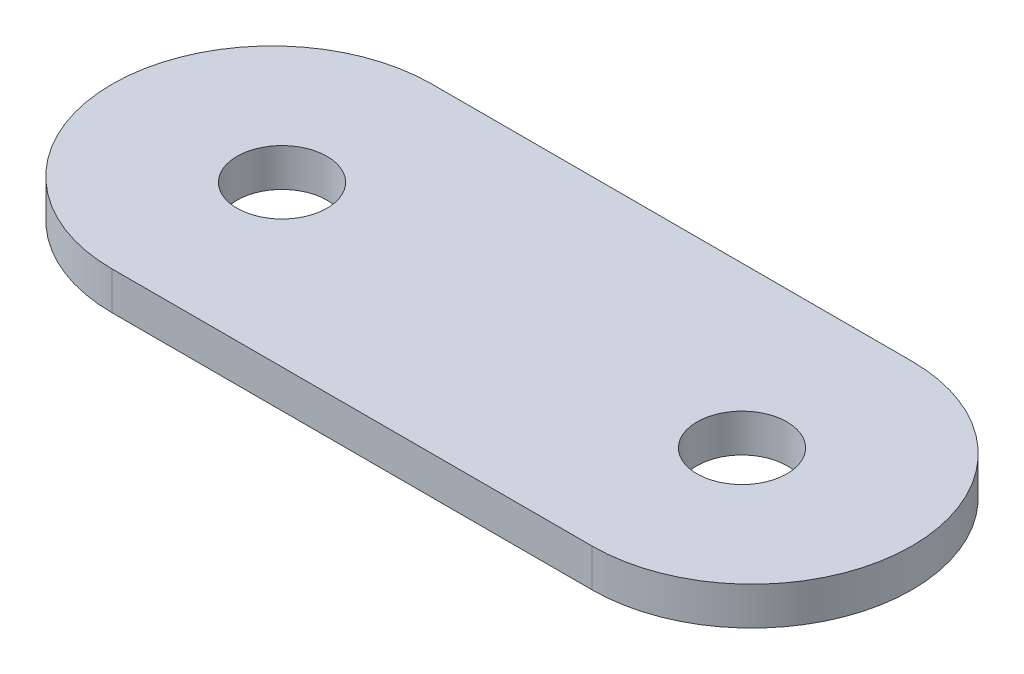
from build123d import *

# Parameters (mm, degrees)
SKETCH1_R           = 2.25
BOSS_EXTRUDE1_DEPTH = 1.9


with BuildPart() as part:
    # Sketch1 → Boss-Extrude1 (new body)
    with BuildSketch(Plane(origin=(0, 0, 0), x_dir=(1, 0, 0), z_dir=(0, 1, 0))):
        with BuildLine():
            Line((-12, 8), (12, 8))
            ThreePointArc((12, 8), (20, 0), (12, -8))
            Line((12, -8), (-12, -8))
            ThreePointArc((-12, -8), (-20, 0), (-12, 8))
        make_face()
        with Locations(Location((-11.5, 0, 0), (0, 0, 90))):
            Circle(SKETCH1_R, mode=Mode.SUBTRACT)
        with Locations(Location((11.5, 0, 0), (0, 0, 90))):
            Circle(SKETCH1_R, mode=Mode.SUBTRACT)
    extrude(amount=BOSS_EXTRUDE1_DEPTH)


solid = part.part
